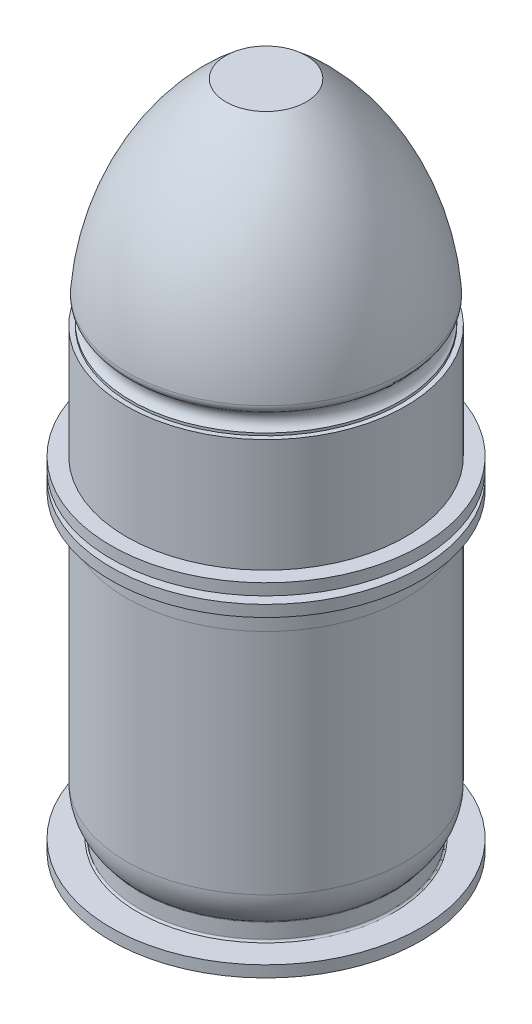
from build123d import *


with BuildPart() as part:
    # Sketch1 → Revolve1 (revolve)
    with BuildSketch(Plane.XY, mode=Mode.PRIVATE) as revolve1_sk:
        with BuildLine():
            ThreePointArc((-17.659117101, 62.992), (-17.018, 64.5795), (-17.659117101, 66.167))
            ThreePointArc((-17.659117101, 66.167), (-17.832701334, 66.329093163), (-18.022166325, 66.472301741))
            ThreePointArc((-18.022166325, 66.472301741), (-18.10837631, 66.571971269), (-18.133042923, 66.701422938))
            ThreePointArc((-18.133042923, 66.701422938), (-14.221403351, 80.460100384), (-5.196763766, 91.557758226))
            Line((-5.196763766, 91.557758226), (0, 91.557758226))
            Line((0, 91.557758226), (0, 92.573758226))
            Line((0, 92.573758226), (-5.55625, 92.573758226))
            ThreePointArc((-5.55625, 92.573758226), (-15.002976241, 81.157132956), (-19.134808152, 66.926604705))
            ThreePointArc((-19.134808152, 66.926604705), (-19.005468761, 66.261087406), (-18.552172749, 65.756939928))
            ThreePointArc((-18.552172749, 65.756939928), (-17.908500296, 64.514773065), (-18.664391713, 63.337521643))
            Line((-18.664391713, 63.337521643), (-18.664391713, 62.992))
            Line((-18.664391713, 62.992), (-17.659117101, 62.992))
        make_face()
        with BuildLine():
            Line((-18.415, 40.005), (-19.304, 40.005))
            Line((-19.304, 40.005), (-19.304, 8.442634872))
            ThreePointArc((-19.304, 8.442634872), (-18.84472262, 6.071582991), (-17.533326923, 4.043513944))
            ThreePointArc((-17.533326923, 4.043513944), (-17.480871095, 3.962391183), (-17.4625, 3.867549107))
            Line((-17.4625, 3.867549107), (-17.4625, 1.8288))
            ThreePointArc((-17.4625, 1.8288), (-17.536894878, 1.649194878), (-17.7165, 1.5748))
            Line((-17.7165, 1.5748), (-21.43125, 1.5748))
            Line((-21.43125, 1.5748), (-21.43125, 0))
            Line((-21.43125, 0), (-5.715, 0))
            Line((-5.715, 0), (-5.715, 2.286))
            Line((-5.715, 2.286), (-6.096, 2.286))
            Line((-6.096, 2.286), (-6.096, 4.826))
            Line((-6.096, 4.826), (-5.715, 4.826))
            Line((-5.715, 4.826), (-5.715, 15.113))
            ThreePointArc((-5.715, 15.113), (-5.491815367, 15.651815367), (-4.953, 15.875))
            Line((-4.953, 15.875), (0, 15.875))
            Line((0, 15.875), (0, 19.05))
            Line((0, 19.05), (-8.636, 19.05))
            ThreePointArc((-8.636, 19.05), (-9.534025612, 18.678025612), (-9.906, 17.78))
            Line((-9.906, 17.78), (-9.906, 7.112))
            ThreePointArc((-9.906, 7.112), (-10.277974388, 6.213974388), (-11.176, 5.842))
            Line((-11.176, 5.842), (-11.334514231, 5.842))
            ThreePointArc((-11.334514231, 5.842), (-15.765483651, 7.643482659), (-17.682338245, 12.025776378))
            Line((-17.682338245, 12.025776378), (-18.359873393, 37.899799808))
            ThreePointArc((-18.359873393, 37.899799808), (-18.378769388, 38.380734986), (-18.385069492, 38.862))
            Line((-18.385069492, 38.862), (-18.415, 40.005))
        make_face()
    revolve(revolve1_sk.sketch.rotate(Axis((0, 0, 0), (0, 1, 0)), 270), axis=Axis((0, 0, 0), (0, 1, 0)))


with BuildPart() as body_2:
    # Sketch1_3 → Revolve2 (revolve)
    with BuildSketch(Plane.XY, mode=Mode.PRIVATE) as revolve2_sk:
        with BuildLine():
            Line((-19.304, 43.18), (-19.304, 40.005))
            Line((-19.304, 40.005), (-18.415, 40.005))
            Line((-18.415, 40.005), (-18.385069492, 38.862))
            Line((-18.385069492, 38.862), (-18.359873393, 37.899799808))
            ThreePointArc((-18.359873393, 37.899799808), (-17.409262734, 32.951978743), (-15.151217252, 28.448))
            Line((-15.151217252, 28.448), (-14.41100288, 28.448))
            ThreePointArc((-14.41100288, 28.448), (-17.084045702, 33.936171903), (-17.743222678, 40.005))
            ThreePointArc((-17.743222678, 40.005), (-17.321728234, 47.000847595), (-16.0655, 53.895877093))
            Line((-16.0655, 53.895877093), (-16.0655, 66.167))
            Line((-16.0655, 66.167), (-17.659117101, 66.167))
            ThreePointArc((-17.659117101, 66.167), (-17.018, 64.5795), (-17.659117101, 62.992))
            Line((-17.659117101, 62.992), (-18.664391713, 62.992))
            Line((-18.664391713, 62.992), (-19.304, 62.992))
            Line((-19.304, 62.992), (-19.304, 47.3456))
            Line((-19.304, 47.3456), (-21.43125, 47.3456))
            Line((-21.43125, 47.3456), (-21.43125, 45.7708))
            Line((-21.43125, 45.7708), (-19.304, 45.7708))
            Line((-19.304, 45.7708), (-19.304, 44.7548))
            Line((-19.304, 44.7548), (-21.43125, 44.7548))
            Line((-21.43125, 44.7548), (-21.43125, 43.18))
            Line((-21.43125, 43.18), (-19.304, 43.18))
        make_face()
    revolve(revolve2_sk.sketch.rotate(Axis((0, 0, 0), (0, 1, 0)), 270), axis=Axis((0, 0, 0), (0, 1, 0)))


with BuildPart() as body_3:
    # Sketch1_4 → Revolve3 (revolve)
    with BuildSketch(Plane.XY):
        with BuildLine():
            Line((0, 56.642), (0, 21.082))
            ThreePointArc((0, 21.082), (-17.78, 38.862), (0, 56.642))
        make_face()
    revolve(axis=Axis((0, 56.642, 0), (0, -1, 0)))


with BuildPart() as body_4:
    # Sketch2 → Revolve4 (revolve)
    with BuildSketch(Plane.XY, mode=Mode.PRIVATE) as revolve4_sk:
        with BuildLine():
            Line((0, 2.3622), (0, 15.875))
            Line((0, 15.875), (-4.953, 15.875))
            ThreePointArc((-4.953, 15.875), (-5.491815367, 15.651815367), (-5.715, 15.113))
            Line((-5.715, 15.113), (-5.715, 6.305063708))
            Line((-5.715, 6.305063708), (-1.143, 5.08))
            Line((-1.143, 5.08), (-1.143, 3.81))
            Line((-1.143, 3.81), (-1.9177, 3.0353))
            Line((-1.9177, 3.0353), (-1.9177, 2.3622))
            Line((-1.9177, 2.3622), (0, 2.3622))
        make_face()
    revolve(revolve4_sk.sketch.rotate(Axis((0, 0, 0), (0, 1, 0)), 270), axis=Axis((0, 0, 0), (0, 1, 0)))


with BuildPart() as body_5:
    # Sketch2_3 → Revolve6 (revolve)
    with BuildSketch(Plane.XY, mode=Mode.PRIVATE) as revolve6_sk:
        Polygon((-1.9177, 1.752298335), (-1.9177, 2.3622), (-1.9177, 3.0353), (-1.143, 3.81), (-1.143, 5.08), (-5.715, 6.305063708), (-5.715, 4.826), (-6.096, 4.826), (-6.096, 2.286), (-5.715, 2.286), (-5.715, 0), (-1.9177, 0), (-1.9177, 1.016), (-1.651, 0.990298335), (-1.651, 1.752298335), align=None)
    revolve(revolve6_sk.sketch.rotate(Axis((0, 0, 0), (0, 1, 0)), 270), axis=Axis((0, 0, 0), (0, 1, 0)))


with BuildPart() as body_6:
    # Sketch2_4 → Revolve7 (revolve)
    with BuildSketch(Plane.XY, mode=Mode.PRIVATE) as revolve7_sk:
        Polygon((0, 0), (-1.9177, 0), (-1.9177, 1.016), (-1.651, 0.990298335), (-1.651, 1.752298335), (-1.9177, 1.752298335), (-1.9177, 2.3622), (0, 2.3622), align=None)
    revolve(revolve7_sk.sketch.rotate(Axis((0, 0, 0), (0, 1, 0)), 270), axis=Axis((0, 0, 0), (0, 1, 0)))


solid = Compound([part.part, body_2.part, body_3.part, body_4.part, body_5.part, body_6.part])
